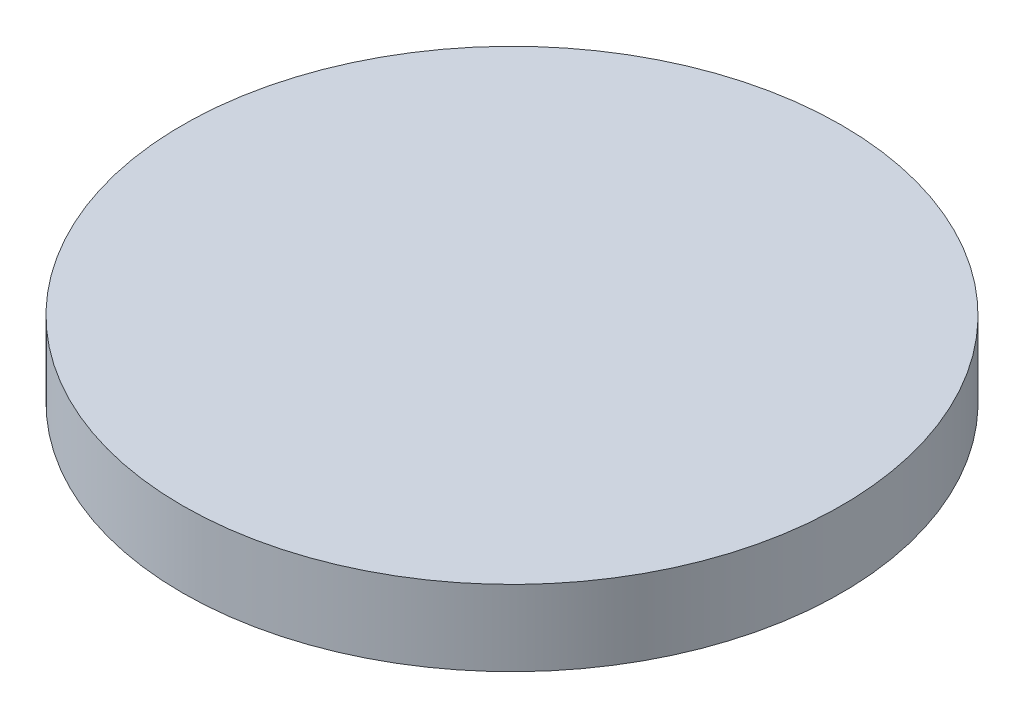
from build123d import *

# Parameters (mm, degrees)
SKETCH1_R           = 87.2
BOSS_EXTRUDE1_DEPTH = 10


with BuildPart() as part:
    # Sketch1 → Boss-Extrude1 (new, symmetric)
    with BuildSketch(Plane(origin=(0, 0, 0), x_dir=(1, 0, 0), z_dir=(0, 1, 0))):
        with Locations(Location((0, 0, 0), (0, 0, 270))):
            Circle(SKETCH1_R)
    extrude(amount=BOSS_EXTRUDE1_DEPTH, both=True)


solid = part.part
